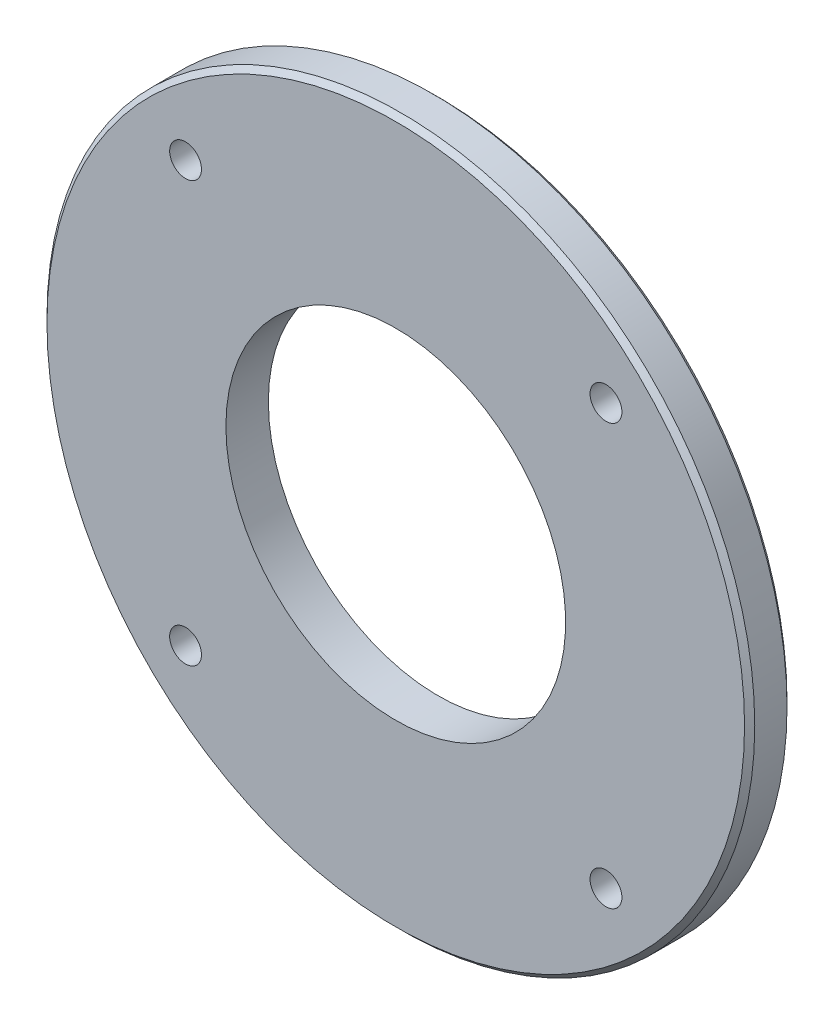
from build123d import *

# Parameters (mm, degrees)
SKETCH1_R          = 79.375
SKETCH1_R_2        = 38.1
EXTRUDE1_DEPTH     = 9.525
SKETCH2_R          = 3.5687
CUT_EXTRUDE1_DEPTH = 9.525
CIRPATTERN1_COUNT  = 4
CHAMFER1_SIZE      = 1.143


with BuildPart() as part:
    # Sketch1 → Extrude1 (new body)
    with BuildSketch(Plane.XY):
        with Locations(Location((0, 0, 0), (0, 0, 180))):
            Circle(SKETCH1_R)
        with Locations(Location((0, 0, 0), (0, 0, 180))):
            Circle(SKETCH1_R_2, mode=Mode.SUBTRACT)
    extrude(amount=EXTRUDE1_DEPTH)

    # Sketch2 → Cut-Extrude1 (cut)
    with BuildSketch(Plane.XY.offset(9.525)):
        with Locations((47.146344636, 47.146344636)):
            Circle(SKETCH2_R)
    cut_extrude1 = extrude(amount=-CUT_EXTRUDE1_DEPTH, mode=Mode.SUBTRACT)

    # CirPattern1: Cut-Extrude1 ×4 about axis
    cirpattern1_axis = Axis((0, 0, 0), (0, 0, 1))
    for i in range(1, CIRPATTERN1_COUNT):
        add(cut_extrude1.rotate(cirpattern1_axis, i * 360 / CIRPATTERN1_COUNT), mode=Mode.SUBTRACT)

    # Chamfer1
    chamfer1_edges = [part.edges().sort_by_distance(p)[0] for p in [
        (79.375, 0, 0),
        (79.375, 0, 9.525),
    ]]
    chamfer(chamfer1_edges, length=CHAMFER1_SIZE)


solid = part.part
